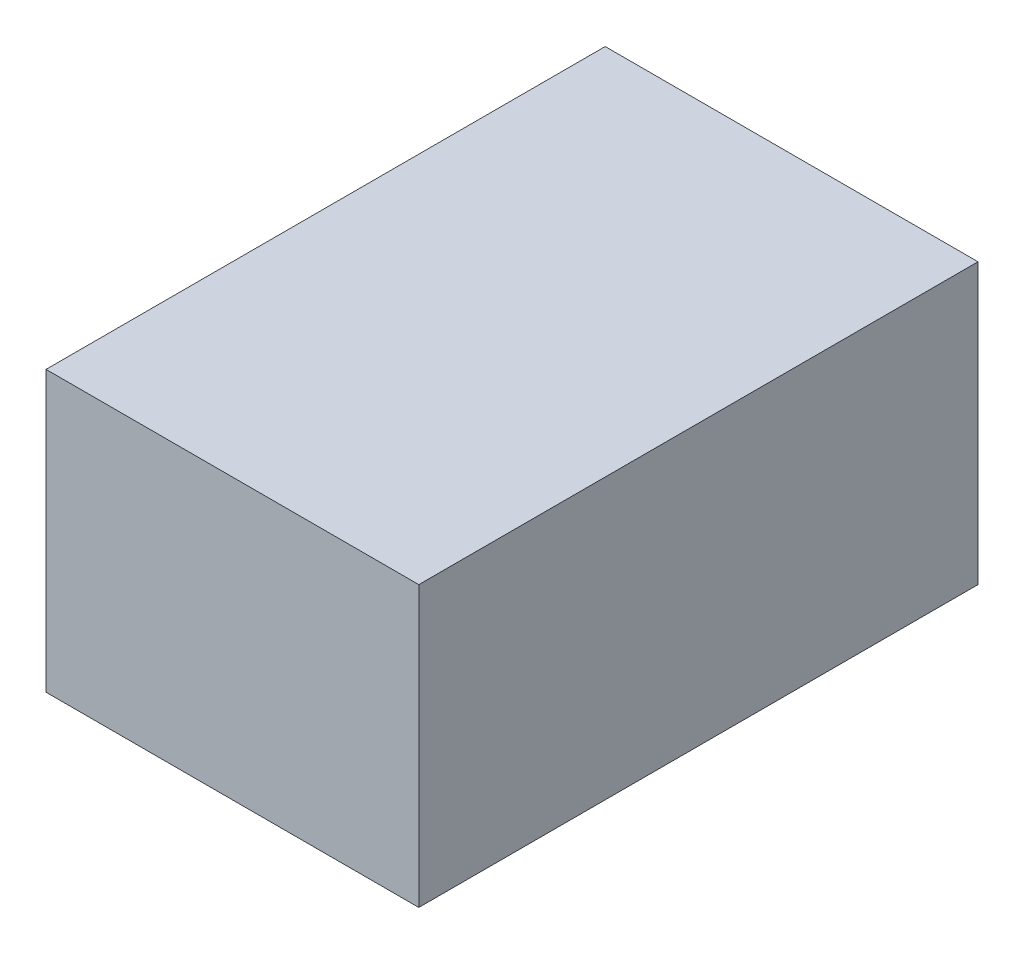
ISO-10303-21;
HEADER;
FILE_DESCRIPTION(('STEP AP214'),'2;1');
FILE_NAME('part.step','',(''),(''),'','','');
FILE_SCHEMA(('AUTOMOTIVE_DESIGN { 1 0 10303 214 1 1 1 1 }'));
ENDSEC;
DATA;
#1=APPLICATION_CONTEXT('core data for automotive mechanical design processes');
#2=APPLICATION_PROTOCOL_DEFINITION('international standard','automotive_design',2000,#1);
#3=PRODUCT_CONTEXT('',#1,'mechanical');
#4=PRODUCT('Part','Part','',(#3));
#5=PRODUCT_RELATED_PRODUCT_CATEGORY('part','',(#4));
#6=PRODUCT_DEFINITION_FORMATION('','',#4);
#7=PRODUCT_DEFINITION_CONTEXT('part definition',#1,'design');
#8=PRODUCT_DEFINITION('design','',#6,#7);
#9=PRODUCT_DEFINITION_SHAPE('','',#8);
#10=(LENGTH_UNIT() NAMED_UNIT(*) SI_UNIT(.MILLI.,.METRE.));
#11=(NAMED_UNIT(*) PLANE_ANGLE_UNIT() SI_UNIT($,.RADIAN.));
#12=(NAMED_UNIT(*) SI_UNIT($,.STERADIAN.) SOLID_ANGLE_UNIT());
#13=UNCERTAINTY_MEASURE_WITH_UNIT(LENGTH_MEASURE(1.E-05),#10,'distance_accuracy_value','');
#14=(GEOMETRIC_REPRESENTATION_CONTEXT(3) GLOBAL_UNCERTAINTY_ASSIGNED_CONTEXT((#13)) GLOBAL_UNIT_ASSIGNED_CONTEXT((#10,
#11,#12)) REPRESENTATION_CONTEXT('',''));
#15=CARTESIAN_POINT('',(0.,0.,0.));
#16=DIRECTION('',(0.,0.,1.));
#17=DIRECTION('',(1.,0.,0.));
#18=AXIS2_PLACEMENT_3D('',#15,#16,#17);
#19=CARTESIAN_POINT('',(20.,-7.5,-15.));
#20=DIRECTION('',(0.,0.,1.));
#21=DIRECTION('',(1.,0.,0.));
#22=AXIS2_PLACEMENT_3D('',#19,#20,#21);
#23=PLANE('',#22);
#24=DIRECTION('',(0.,1.,0.));
#25=VECTOR('',#24,1.);
#26=CARTESIAN_POINT('',(0.,-7.5,-15.));
#27=LINE('',#26,#25);
#28=CARTESIAN_POINT('',(0.,-7.5,-15.));
#29=VERTEX_POINT('',#28);
#30=CARTESIAN_POINT('',(0.,7.5,-15.));
#31=VERTEX_POINT('',#30);
#32=EDGE_CURVE('E96',#29,#31,#27,.T.);
#33=ORIENTED_EDGE('',*,*,#32,.T.);
#34=DIRECTION('',(-1.,0.,0.));
#35=VECTOR('',#34,1.);
#36=CARTESIAN_POINT('',(20.,7.5,-15.));
#37=LINE('',#36,#35);
#38=CARTESIAN_POINT('',(20.,7.5,-15.));
#39=VERTEX_POINT('',#38);
#40=EDGE_CURVE('E11',#39,#31,#37,.T.);
#41=ORIENTED_EDGE('',*,*,#40,.F.);
#42=DIRECTION('',(0.,1.,0.));
#43=VECTOR('',#42,1.);
#44=CARTESIAN_POINT('',(20.,-7.5,-15.));
#45=LINE('',#44,#43);
#46=CARTESIAN_POINT('',(20.,-7.5,-15.));
#47=VERTEX_POINT('',#46);
#48=EDGE_CURVE('E84',#47,#39,#45,.T.);
#49=ORIENTED_EDGE('',*,*,#48,.F.);
#50=DIRECTION('',(-1.,0.,0.));
#51=VECTOR('',#50,1.);
#52=CARTESIAN_POINT('',(20.,-7.5,-15.));
#53=LINE('',#52,#51);
#54=EDGE_CURVE('E92',#47,#29,#53,.T.);
#55=ORIENTED_EDGE('',*,*,#54,.T.);
#56=EDGE_LOOP('',(#33,#41,#49,#55));
#57=FACE_BOUND('',#56,.T.);
#58=ADVANCED_FACE('F33',(#57),#23,.F.);
#59=CARTESIAN_POINT('',(20.,7.5,15.));
#60=DIRECTION('',(0.,-1.,0.));
#61=DIRECTION('',(0.,0.,-1.));
#62=AXIS2_PLACEMENT_3D('',#59,#60,#61);
#63=PLANE('',#62);
#64=DIRECTION('',(0.,0.,1.));
#65=VECTOR('',#64,1.);
#66=CARTESIAN_POINT('',(0.,7.5,15.));
#67=LINE('',#66,#65);
#68=CARTESIAN_POINT('',(0.,7.5,15.));
#69=VERTEX_POINT('',#68);
#70=EDGE_CURVE('E88',#31,#69,#67,.T.);
#71=ORIENTED_EDGE('',*,*,#70,.T.);
#72=DIRECTION('',(-1.,0.,0.));
#73=VECTOR('',#72,1.);
#74=CARTESIAN_POINT('',(20.,7.5,15.));
#75=LINE('',#74,#73);
#76=CARTESIAN_POINT('',(20.,7.5,15.));
#77=VERTEX_POINT('',#76);
#78=EDGE_CURVE('E41',#77,#69,#75,.T.);
#79=ORIENTED_EDGE('',*,*,#78,.F.);
#80=DIRECTION('',(0.,0.,1.));
#81=VECTOR('',#80,1.);
#82=CARTESIAN_POINT('',(20.,7.5,15.));
#83=LINE('',#82,#81);
#84=EDGE_CURVE('E79',#39,#77,#83,.T.);
#85=ORIENTED_EDGE('',*,*,#84,.F.);
#86=ORIENTED_EDGE('',*,*,#40,.T.);
#87=EDGE_LOOP('',(#71,#79,#85,#86));
#88=FACE_BOUND('',#87,.T.);
#89=ADVANCED_FACE('F87',(#88),#63,.F.);
#90=CARTESIAN_POINT('',(20.,-7.5,15.));
#91=DIRECTION('',(0.,0.,-1.));
#92=DIRECTION('',(-1.,0.,0.));
#93=AXIS2_PLACEMENT_3D('',#90,#91,#92);
#94=PLANE('',#93);
#95=DIRECTION('',(0.,-1.,0.));
#96=VECTOR('',#95,1.);
#97=CARTESIAN_POINT('',(0.,-7.5,15.));
#98=LINE('',#97,#96);
#99=CARTESIAN_POINT('',(0.,-7.5,15.));
#100=VERTEX_POINT('',#99);
#101=EDGE_CURVE('E66',#69,#100,#98,.T.);
#102=ORIENTED_EDGE('',*,*,#101,.T.);
#103=DIRECTION('',(-1.,0.,0.));
#104=VECTOR('',#103,1.);
#105=CARTESIAN_POINT('',(20.,-7.5,15.));
#106=LINE('',#105,#104);
#107=CARTESIAN_POINT('',(20.,-7.5,15.));
#108=VERTEX_POINT('',#107);
#109=EDGE_CURVE('E89',#108,#100,#106,.T.);
#110=ORIENTED_EDGE('',*,*,#109,.F.);
#111=DIRECTION('',(0.,-1.,0.));
#112=VECTOR('',#111,1.);
#113=CARTESIAN_POINT('',(20.,-7.5,15.));
#114=LINE('',#113,#112);
#115=EDGE_CURVE('E82',#77,#108,#114,.T.);
#116=ORIENTED_EDGE('',*,*,#115,.F.);
#117=ORIENTED_EDGE('',*,*,#78,.T.);
#118=EDGE_LOOP('',(#102,#110,#116,#117));
#119=FACE_BOUND('',#118,.T.);
#120=ADVANCED_FACE('F90',(#119),#94,.F.);
#121=CARTESIAN_POINT('',(20.,-7.5,15.));
#122=DIRECTION('',(0.,1.,0.));
#123=DIRECTION('',(0.,0.,1.));
#124=AXIS2_PLACEMENT_3D('',#121,#122,#123);
#125=PLANE('',#124);
#126=DIRECTION('',(0.,0.,-1.));
#127=VECTOR('',#126,1.);
#128=CARTESIAN_POINT('',(0.,-7.5,15.));
#129=LINE('',#128,#127);
#130=EDGE_CURVE('E72',#100,#29,#129,.T.);
#131=ORIENTED_EDGE('',*,*,#130,.T.);
#132=ORIENTED_EDGE('',*,*,#54,.F.);
#133=DIRECTION('',(0.,0.,-1.));
#134=VECTOR('',#133,1.);
#135=CARTESIAN_POINT('',(20.,-7.5,15.));
#136=LINE('',#135,#134);
#137=EDGE_CURVE('E49',#108,#47,#136,.T.);
#138=ORIENTED_EDGE('',*,*,#137,.F.);
#139=ORIENTED_EDGE('',*,*,#109,.T.);
#140=EDGE_LOOP('',(#131,#132,#138,#139));
#141=FACE_BOUND('',#140,.T.);
#142=ADVANCED_FACE('F103',(#141),#125,.F.);
#143=CARTESIAN_POINT('',(20.,7.5,-15.));
#144=DIRECTION('',(-1.,0.,0.));
#145=DIRECTION('',(0.,0.,1.));
#146=AXIS2_PLACEMENT_3D('',#143,#144,#145);
#147=PLANE('',#146);
#148=ORIENTED_EDGE('',*,*,#48,.T.);
#149=ORIENTED_EDGE('',*,*,#84,.T.);
#150=ORIENTED_EDGE('',*,*,#115,.T.);
#151=ORIENTED_EDGE('',*,*,#137,.T.);
#152=EDGE_LOOP('',(#148,#149,#150,#151));
#153=FACE_BOUND('',#152,.T.);
#154=ADVANCED_FACE('F80',(#153),#147,.F.);
#155=CARTESIAN_POINT('',(0.,7.5,-15.));
#156=DIRECTION('',(-1.,0.,0.));
#157=DIRECTION('',(0.,0.,1.));
#158=AXIS2_PLACEMENT_3D('',#155,#156,#157);
#159=PLANE('',#158);
#160=ORIENTED_EDGE('',*,*,#32,.F.);
#161=ORIENTED_EDGE('',*,*,#130,.F.);
#162=ORIENTED_EDGE('',*,*,#101,.F.);
#163=ORIENTED_EDGE('',*,*,#70,.F.);
#164=EDGE_LOOP('',(#160,#161,#162,#163));
#165=FACE_BOUND('',#164,.T.);
#166=ADVANCED_FACE('F106',(#165),#159,.T.);
#167=CLOSED_SHELL('',(#58,#89,#120,#142,#154,#166));
#168=MANIFOLD_SOLID_BREP('B2',#167);
#169=ADVANCED_BREP_SHAPE_REPRESENTATION('',(#18,#168),#14);
#170=SHAPE_DEFINITION_REPRESENTATION(#9,#169);
ENDSEC;
END-ISO-10303-21;
